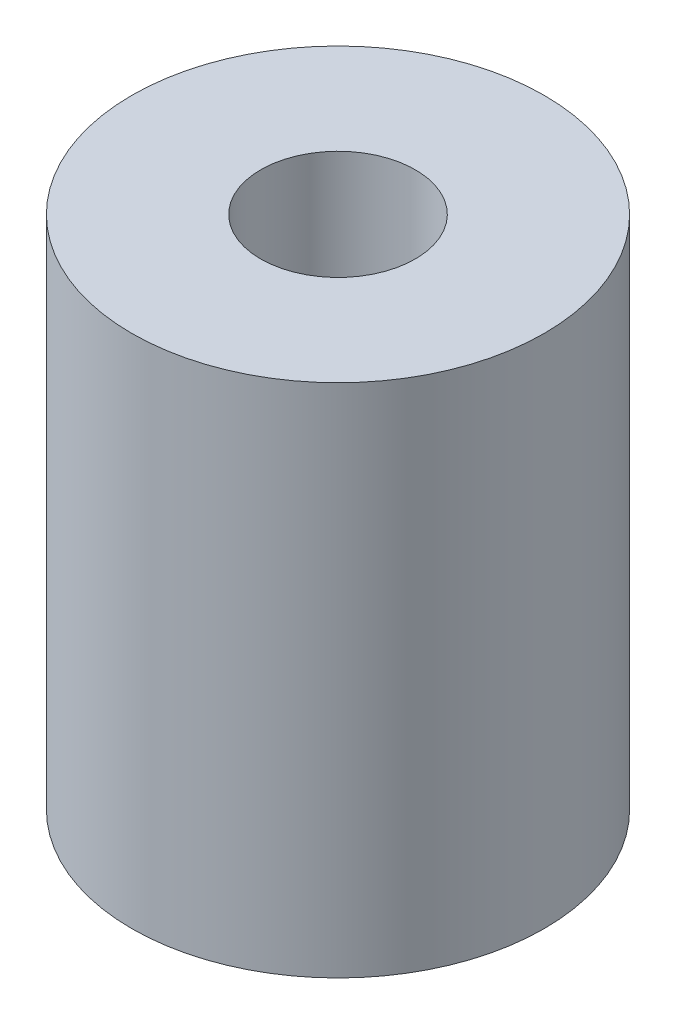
from build123d import *

# Parameters (mm, degrees)
SKETCH1_R                       = 4
EXTRUDE1_DEPTH                  = 10
SKETCH7_R                       = 3
EXTRUDE4_DEPTH                  = 0.5
M3X0_5_TAPPED_HOLE2_D           = 2.5
M3X0_5_TAPPED_HOLE2_CBORE_D     = 3
M3X0_5_TAPPED_HOLE2_CBORE_DEPTH = 6


with BuildPart() as part:
    # Sketch1 → Extrude1 (new body)
    with BuildSketch(Plane(origin=(0, 0, 0), x_dir=(1, 0, 0), z_dir=(0, 1, 0))):
        with Locations(Location((0, 0, 0), (0, 0, 270))):
            Circle(SKETCH1_R)
    extrude(amount=EXTRUDE1_DEPTH)

    # Sketch7 → Extrude4 (add)
    with BuildSketch(Plane.XZ):
        with Locations(Location((0, 0, 0), (0, 0, 90))):
            Circle(SKETCH7_R)
    extrude(amount=EXTRUDE4_DEPTH)

    # M3x0.5 Tapped Hole2 (through all)
    with Locations(Plane.ZX.offset(10)):
        with Locations((0, 0)):
            CounterBoreHole(M3X0_5_TAPPED_HOLE2_D / 2, M3X0_5_TAPPED_HOLE2_CBORE_D / 2, M3X0_5_TAPPED_HOLE2_CBORE_DEPTH)


solid = part.part
